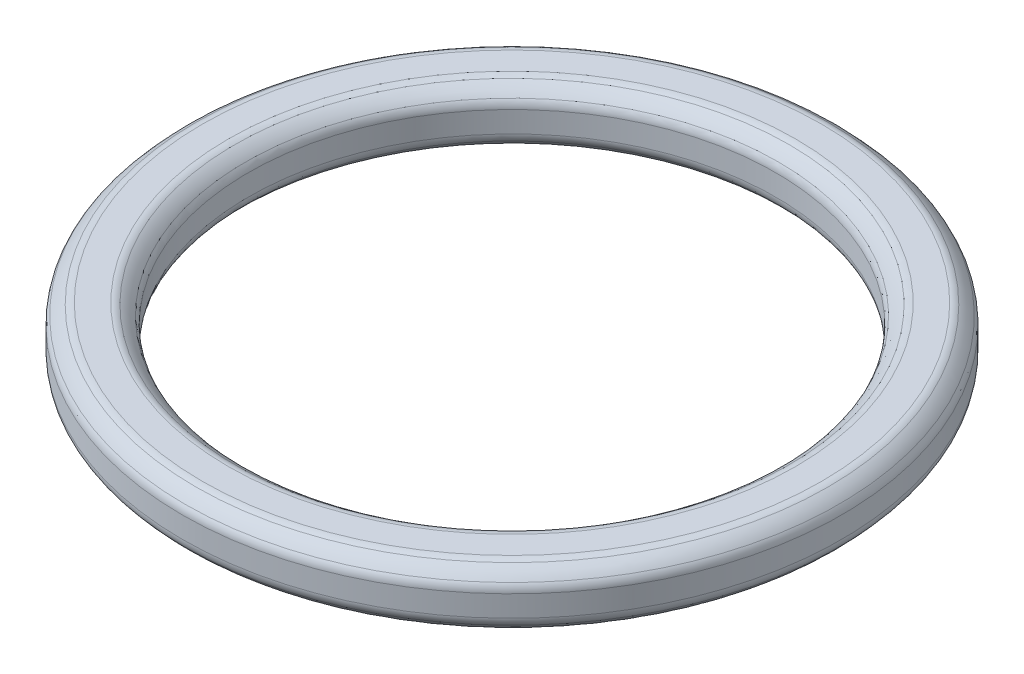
ISO-10303-21;
HEADER;
FILE_DESCRIPTION(('STEP AP214'),'2;1');
FILE_NAME('part.step','',(''),(''),'','','');
FILE_SCHEMA(('AUTOMOTIVE_DESIGN { 1 0 10303 214 1 1 1 1 }'));
ENDSEC;
DATA;
#1=APPLICATION_CONTEXT('core data for automotive mechanical design processes');
#2=APPLICATION_PROTOCOL_DEFINITION('international standard','automotive_design',2000,#1);
#3=PRODUCT_CONTEXT('',#1,'mechanical');
#4=PRODUCT('Part','Part','',(#3));
#5=PRODUCT_RELATED_PRODUCT_CATEGORY('part','',(#4));
#6=PRODUCT_DEFINITION_FORMATION('','',#4);
#7=PRODUCT_DEFINITION_CONTEXT('part definition',#1,'design');
#8=PRODUCT_DEFINITION('design','',#6,#7);
#9=PRODUCT_DEFINITION_SHAPE('','',#8);
#10=(LENGTH_UNIT() NAMED_UNIT(*) SI_UNIT(.MILLI.,.METRE.));
#11=(NAMED_UNIT(*) PLANE_ANGLE_UNIT() SI_UNIT($,.RADIAN.));
#12=(NAMED_UNIT(*) SI_UNIT($,.STERADIAN.) SOLID_ANGLE_UNIT());
#13=UNCERTAINTY_MEASURE_WITH_UNIT(LENGTH_MEASURE(1.E-05),#10,'distance_accuracy_value','');
#14=(GEOMETRIC_REPRESENTATION_CONTEXT(3) GLOBAL_UNCERTAINTY_ASSIGNED_CONTEXT((#13)) GLOBAL_UNIT_ASSIGNED_CONTEXT((#10,
#11,#12)) REPRESENTATION_CONTEXT('',''));
#15=CARTESIAN_POINT('',(0.,0.,0.));
#16=DIRECTION('',(0.,0.,1.));
#17=DIRECTION('',(1.,0.,0.));
#18=AXIS2_PLACEMENT_3D('',#15,#16,#17);
#19=CARTESIAN_POINT('',(9.,0.9,0.));
#20=DIRECTION('',(0.,0.,1.));
#21=DIRECTION('',(1.,0.,0.));
#22=AXIS2_PLACEMENT_3D('',#19,#20,#21);
#23=ELLIPSE('',#22,1.11111111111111,1.);
#24=CARTESIAN_POINT('',(0.,0.,0.));
#25=DIRECTION('',(0.,-1.,0.));
#26=AXIS1_PLACEMENT('',#24,#25);
#27=SURFACE_OF_REVOLUTION('',#23,#26);
#28=CARTESIAN_POINT('',(0.,1.74897301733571,0.));
#29=DIRECTION('',(0.,-1.,0.));
#30=DIRECTION('',(0.,0.,-1.));
#31=AXIS2_PLACEMENT_3D('',#28,#29,#30);
#32=CIRCLE('',#31,9.5871513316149);
#33=CARTESIAN_POINT('',(0.,1.74897301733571,-9.5871513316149));
#34=VERTEX_POINT('',#33);
#35=EDGE_CURVE('E64',#34,#34,#32,.T.);
#36=ORIENTED_EDGE('',*,*,#35,.T.);
#37=EDGE_LOOP('',(#36));
#38=FACE_BOUND('',#37,.T.);
#39=CARTESIAN_POINT('',(0.,1.46156085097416,0.));
#40=DIRECTION('',(0.,-1.,0.));
#41=DIRECTION('',(0.,0.,-1.));
#42=AXIS2_PLACEMENT_3D('',#39,#40,#41);
#43=CIRCLE('',#42,9.91937271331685);
#44=CARTESIAN_POINT('',(0.,1.46156085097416,-9.91937271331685));
#45=VERTEX_POINT('',#44);
#46=EDGE_CURVE('E67',#45,#45,#43,.F.);
#47=ORIENTED_EDGE('',*,*,#46,.T.);
#48=EDGE_LOOP('',(#47));
#49=FACE_BOUND('',#48,.T.);
#50=ADVANCED_FACE('F14',(#38,#49),#27,.F.);
#51=CARTESIAN_POINT('',(8.51567789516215,1.8,0.));
#52=DIRECTION('',(0.,1.,0.));
#53=DIRECTION('',(0.,0.,1.));
#54=AXIS2_PLACEMENT_3D('',#51,#52,#53);
#55=PLANE('',#54);
#56=CARTESIAN_POINT('',(0.,1.8,0.));
#57=DIRECTION('',(0.,1.,0.));
#58=DIRECTION('',(0.,0.,1.));
#59=AXIS2_PLACEMENT_3D('',#56,#57,#58);
#60=CIRCLE('',#59,9.39165751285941);
#61=CARTESIAN_POINT('',(0.,1.8,9.39165751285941));
#62=VERTEX_POINT('',#61);
#63=EDGE_CURVE('E58',#62,#62,#60,.T.);
#64=ORIENTED_EDGE('',*,*,#63,.T.);
#65=EDGE_LOOP('',(#64));
#66=FACE_BOUND('',#65,.T.);
#67=CARTESIAN_POINT('',(0.,1.8,0.));
#68=DIRECTION('',(0.,1.,0.));
#69=DIRECTION('',(0.,0.,1.));
#70=AXIS2_PLACEMENT_3D('',#67,#68,#69);
#71=CIRCLE('',#70,8.6083424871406);
#72=CARTESIAN_POINT('',(0.,1.8,8.6083424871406));
#73=VERTEX_POINT('',#72);
#74=EDGE_CURVE('E61',#73,#73,#71,.F.);
#75=ORIENTED_EDGE('',*,*,#74,.T.);
#76=EDGE_LOOP('',(#75));
#77=FACE_BOUND('',#76,.T.);
#78=ADVANCED_FACE('F96',(#66,#77),#55,.T.);
#79=CARTESIAN_POINT('',(9.,0.9,0.));
#80=DIRECTION('',(0.,0.,1.));
#81=DIRECTION('',(1.,0.,0.));
#82=AXIS2_PLACEMENT_3D('',#79,#80,#81);
#83=ELLIPSE('',#82,1.11111111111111,1.);
#84=CARTESIAN_POINT('',(0.,0.,0.));
#85=DIRECTION('',(0.,-1.,0.));
#86=AXIS1_PLACEMENT('',#84,#85);
#87=SURFACE_OF_REVOLUTION('',#83,#86);
#88=CARTESIAN_POINT('',(0.,1.74897301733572,0.));
#89=DIRECTION('',(0.,-1.,0.));
#90=DIRECTION('',(0.,0.,-1.));
#91=AXIS2_PLACEMENT_3D('',#88,#89,#90);
#92=CIRCLE('',#91,8.41284866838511);
#93=CARTESIAN_POINT('',(0.,1.74897301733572,-8.41284866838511));
#94=VERTEX_POINT('',#93);
#95=EDGE_CURVE('E52',#94,#94,#92,.F.);
#96=ORIENTED_EDGE('',*,*,#95,.T.);
#97=EDGE_LOOP('',(#96));
#98=FACE_BOUND('',#97,.T.);
#99=CARTESIAN_POINT('',(0.,1.46156085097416,0.));
#100=DIRECTION('',(0.,-1.,0.));
#101=DIRECTION('',(0.,0.,-1.));
#102=AXIS2_PLACEMENT_3D('',#99,#100,#101);
#103=CIRCLE('',#102,8.08062728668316);
#104=CARTESIAN_POINT('',(0.,1.46156085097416,-8.08062728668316));
#105=VERTEX_POINT('',#104);
#106=EDGE_CURVE('E55',#105,#105,#103,.T.);
#107=ORIENTED_EDGE('',*,*,#106,.T.);
#108=EDGE_LOOP('',(#107));
#109=FACE_BOUND('',#108,.T.);
#110=ADVANCED_FACE('F92',(#98,#109),#87,.F.);
#111=CARTESIAN_POINT('',(0.,0.,0.));
#112=DIRECTION('',(0.,-1.,0.));
#113=DIRECTION('',(0.,0.,-1.));
#114=AXIS2_PLACEMENT_3D('',#111,#112,#113);
#115=CYLINDRICAL_SURFACE('',#114,8.);
#116=CARTESIAN_POINT('',(0.,1.22072673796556,0.));
#117=DIRECTION('',(0.,1.,0.));
#118=DIRECTION('',(0.,0.,1.));
#119=AXIS2_PLACEMENT_3D('',#116,#117,#118);
#120=CIRCLE('',#119,8.);
#121=CARTESIAN_POINT('',(0.,1.22072673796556,8.));
#122=VERTEX_POINT('',#121);
#123=EDGE_CURVE('E46',#122,#122,#120,.T.);
#124=ORIENTED_EDGE('',*,*,#123,.T.);
#125=EDGE_LOOP('',(#124));
#126=FACE_BOUND('',#125,.T.);
#127=CARTESIAN_POINT('',(0.,0.579273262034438,0.));
#128=DIRECTION('',(0.,1.,0.));
#129=DIRECTION('',(0.,0.,1.));
#130=AXIS2_PLACEMENT_3D('',#127,#128,#129);
#131=CIRCLE('',#130,8.);
#132=CARTESIAN_POINT('',(0.,0.579273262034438,8.));
#133=VERTEX_POINT('',#132);
#134=EDGE_CURVE('E49',#133,#133,#131,.F.);
#135=ORIENTED_EDGE('',*,*,#134,.T.);
#136=EDGE_LOOP('',(#135));
#137=FACE_BOUND('',#136,.T.);
#138=ADVANCED_FACE('F88',(#126,#137),#115,.F.);
#139=CARTESIAN_POINT('',(9.,0.9,0.));
#140=DIRECTION('',(0.,0.,1.));
#141=DIRECTION('',(1.,0.,0.));
#142=AXIS2_PLACEMENT_3D('',#139,#140,#141);
#143=ELLIPSE('',#142,1.11111111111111,1.);
#144=CARTESIAN_POINT('',(0.,0.,0.));
#145=DIRECTION('',(0.,-1.,0.));
#146=AXIS1_PLACEMENT('',#144,#145);
#147=SURFACE_OF_REVOLUTION('',#143,#146);
#148=CARTESIAN_POINT('',(0.,0.338439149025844,0.));
#149=DIRECTION('',(0.,-1.,0.));
#150=DIRECTION('',(0.,0.,-1.));
#151=AXIS2_PLACEMENT_3D('',#148,#149,#150);
#152=CIRCLE('',#151,8.08062728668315);
#153=CARTESIAN_POINT('',(0.,0.338439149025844,-8.08062728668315));
#154=VERTEX_POINT('',#153);
#155=EDGE_CURVE('E40',#154,#154,#152,.F.);
#156=ORIENTED_EDGE('',*,*,#155,.T.);
#157=EDGE_LOOP('',(#156));
#158=FACE_BOUND('',#157,.T.);
#159=CARTESIAN_POINT('',(0.,0.0510269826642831,0.));
#160=DIRECTION('',(0.,-1.,0.));
#161=DIRECTION('',(0.,0.,-1.));
#162=AXIS2_PLACEMENT_3D('',#159,#160,#161);
#163=CIRCLE('',#162,8.41284866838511);
#164=CARTESIAN_POINT('',(0.,0.0510269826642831,-8.41284866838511));
#165=VERTEX_POINT('',#164);
#166=EDGE_CURVE('E43',#165,#165,#163,.T.);
#167=ORIENTED_EDGE('',*,*,#166,.T.);
#168=EDGE_LOOP('',(#167));
#169=FACE_BOUND('',#168,.T.);
#170=ADVANCED_FACE('F84',(#158,#169),#147,.F.);
#171=CARTESIAN_POINT('',(8.51567789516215,0.,0.));
#172=DIRECTION('',(0.,-1.,0.));
#173=DIRECTION('',(0.,0.,-1.));
#174=AXIS2_PLACEMENT_3D('',#171,#172,#173);
#175=PLANE('',#174);
#176=CARTESIAN_POINT('',(0.,0.,0.));
#177=DIRECTION('',(0.,-1.,0.));
#178=DIRECTION('',(0.,0.,-1.));
#179=AXIS2_PLACEMENT_3D('',#176,#177,#178);
#180=CIRCLE('',#179,8.6083424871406);
#181=CARTESIAN_POINT('',(0.,0.,-8.6083424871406));
#182=VERTEX_POINT('',#181);
#183=EDGE_CURVE('E34',#182,#182,#180,.F.);
#184=ORIENTED_EDGE('',*,*,#183,.T.);
#185=EDGE_LOOP('',(#184));
#186=FACE_BOUND('',#185,.T.);
#187=CARTESIAN_POINT('',(0.,0.,0.));
#188=DIRECTION('',(0.,-1.,0.));
#189=DIRECTION('',(0.,0.,-1.));
#190=AXIS2_PLACEMENT_3D('',#187,#188,#189);
#191=CIRCLE('',#190,9.39165751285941);
#192=CARTESIAN_POINT('',(0.,0.,-9.39165751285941));
#193=VERTEX_POINT('',#192);
#194=EDGE_CURVE('E37',#193,#193,#191,.T.);
#195=ORIENTED_EDGE('',*,*,#194,.T.);
#196=EDGE_LOOP('',(#195));
#197=FACE_BOUND('',#196,.T.);
#198=ADVANCED_FACE('F80',(#186,#197),#175,.T.);
#199=CARTESIAN_POINT('',(9.,0.9,0.));
#200=DIRECTION('',(0.,0.,1.));
#201=DIRECTION('',(1.,0.,0.));
#202=AXIS2_PLACEMENT_3D('',#199,#200,#201);
#203=ELLIPSE('',#202,1.11111111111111,1.);
#204=CARTESIAN_POINT('',(0.,0.,0.));
#205=DIRECTION('',(0.,-1.,0.));
#206=AXIS1_PLACEMENT('',#204,#205);
#207=SURFACE_OF_REVOLUTION('',#203,#206);
#208=CARTESIAN_POINT('',(0.,0.0510269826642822,0.));
#209=DIRECTION('',(0.,-1.,0.));
#210=DIRECTION('',(0.,0.,-1.));
#211=AXIS2_PLACEMENT_3D('',#208,#209,#210);
#212=CIRCLE('',#211,9.5871513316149);
#213=CARTESIAN_POINT('',(0.,0.0510269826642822,-9.5871513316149));
#214=VERTEX_POINT('',#213);
#215=EDGE_CURVE('E25',#214,#214,#212,.F.);
#216=ORIENTED_EDGE('',*,*,#215,.T.);
#217=EDGE_LOOP('',(#216));
#218=FACE_BOUND('',#217,.T.);
#219=CARTESIAN_POINT('',(0.,0.338439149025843,0.));
#220=DIRECTION('',(0.,-1.,0.));
#221=DIRECTION('',(0.,0.,-1.));
#222=AXIS2_PLACEMENT_3D('',#219,#220,#221);
#223=CIRCLE('',#222,9.91937271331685);
#224=CARTESIAN_POINT('',(0.,0.338439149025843,-9.91937271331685));
#225=VERTEX_POINT('',#224);
#226=EDGE_CURVE('E29',#225,#225,#223,.T.);
#227=ORIENTED_EDGE('',*,*,#226,.T.);
#228=EDGE_LOOP('',(#227));
#229=FACE_BOUND('',#228,.T.);
#230=ADVANCED_FACE('F75',(#218,#229),#207,.F.);
#231=CARTESIAN_POINT('',(0.,0.,0.));
#232=DIRECTION('',(0.,-1.,0.));
#233=DIRECTION('',(0.,0.,-1.));
#234=AXIS2_PLACEMENT_3D('',#231,#232,#233);
#235=CYLINDRICAL_SURFACE('',#234,10.);
#236=CARTESIAN_POINT('',(0.,0.579273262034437,0.));
#237=DIRECTION('',(0.,1.,0.));
#238=DIRECTION('',(0.,0.,1.));
#239=AXIS2_PLACEMENT_3D('',#236,#237,#238);
#240=CIRCLE('',#239,10.);
#241=CARTESIAN_POINT('',(0.,0.579273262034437,10.));
#242=VERTEX_POINT('',#241);
#243=EDGE_CURVE('E10',#242,#242,#240,.T.);
#244=ORIENTED_EDGE('',*,*,#243,.T.);
#245=EDGE_LOOP('',(#244));
#246=FACE_BOUND('',#245,.T.);
#247=CARTESIAN_POINT('',(0.,1.22072673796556,0.));
#248=DIRECTION('',(0.,1.,0.));
#249=DIRECTION('',(0.,0.,1.));
#250=AXIS2_PLACEMENT_3D('',#247,#248,#249);
#251=CIRCLE('',#250,10.);
#252=CARTESIAN_POINT('',(0.,1.22072673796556,10.));
#253=VERTEX_POINT('',#252);
#254=EDGE_CURVE('E21',#253,#253,#251,.F.);
#255=ORIENTED_EDGE('',*,*,#254,.T.);
#256=EDGE_LOOP('',(#255));
#257=FACE_BOUND('',#256,.T.);
#258=ADVANCED_FACE('F79',(#246,#257),#235,.T.);
#259=CARTESIAN_POINT('',(0.,1.4,0.));
#260=DIRECTION('',(0.,-1.,0.));
#261=DIRECTION('',(0.,0.,-1.));
#262=AXIS2_PLACEMENT_3D('',#259,#260,#261);
#263=TOROIDAL_SURFACE('',#262,9.39165751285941,0.4);
#264=ORIENTED_EDGE('',*,*,#63,.F.);
#265=EDGE_LOOP('',(#264));
#266=FACE_BOUND('',#265,.T.);
#267=ORIENTED_EDGE('',*,*,#35,.F.);
#268=EDGE_LOOP('',(#267));
#269=FACE_BOUND('',#268,.T.);
#270=ADVANCED_FACE('F105',(#266,#269),#263,.T.);
#271=CARTESIAN_POINT('',(0.,1.4,0.));
#272=DIRECTION('',(0.,-1.,0.));
#273=DIRECTION('',(0.,0.,-1.));
#274=AXIS2_PLACEMENT_3D('',#271,#272,#273);
#275=TOROIDAL_SURFACE('',#274,8.6083424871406,0.4);
#276=ORIENTED_EDGE('',*,*,#95,.F.);
#277=EDGE_LOOP('',(#276));
#278=FACE_BOUND('',#277,.T.);
#279=ORIENTED_EDGE('',*,*,#74,.F.);
#280=EDGE_LOOP('',(#279));
#281=FACE_BOUND('',#280,.T.);
#282=ADVANCED_FACE('F108',(#278,#281),#275,.T.);
#283=CARTESIAN_POINT('',(0.,1.22072673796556,0.));
#284=DIRECTION('',(0.,1.,0.));
#285=DIRECTION('',(0.,0.,1.));
#286=AXIS2_PLACEMENT_3D('',#283,#284,#285);
#287=TOROIDAL_SURFACE('',#286,8.4,0.4);
#288=ORIENTED_EDGE('',*,*,#123,.F.);
#289=EDGE_LOOP('',(#288));
#290=FACE_BOUND('',#289,.T.);
#291=ORIENTED_EDGE('',*,*,#106,.F.);
#292=EDGE_LOOP('',(#291));
#293=FACE_BOUND('',#292,.T.);
#294=ADVANCED_FACE('F112',(#290,#293),#287,.T.);
#295=CARTESIAN_POINT('',(0.,0.579273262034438,0.));
#296=DIRECTION('',(0.,1.,0.));
#297=DIRECTION('',(0.,0.,1.));
#298=AXIS2_PLACEMENT_3D('',#295,#296,#297);
#299=TOROIDAL_SURFACE('',#298,8.4,0.4);
#300=ORIENTED_EDGE('',*,*,#155,.F.);
#301=EDGE_LOOP('',(#300));
#302=FACE_BOUND('',#301,.T.);
#303=ORIENTED_EDGE('',*,*,#134,.F.);
#304=EDGE_LOOP('',(#303));
#305=FACE_BOUND('',#304,.T.);
#306=ADVANCED_FACE('F116',(#302,#305),#299,.T.);
#307=CARTESIAN_POINT('',(0.,0.4,0.));
#308=DIRECTION('',(0.,-1.,0.));
#309=DIRECTION('',(0.,0.,-1.));
#310=AXIS2_PLACEMENT_3D('',#307,#308,#309);
#311=TOROIDAL_SURFACE('',#310,8.6083424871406,0.4);
#312=ORIENTED_EDGE('',*,*,#183,.F.);
#313=EDGE_LOOP('',(#312));
#314=FACE_BOUND('',#313,.T.);
#315=ORIENTED_EDGE('',*,*,#166,.F.);
#316=EDGE_LOOP('',(#315));
#317=FACE_BOUND('',#316,.T.);
#318=ADVANCED_FACE('F120',(#314,#317),#311,.T.);
#319=CARTESIAN_POINT('',(0.,0.4,0.));
#320=DIRECTION('',(0.,-1.,0.));
#321=DIRECTION('',(0.,0.,-1.));
#322=AXIS2_PLACEMENT_3D('',#319,#320,#321);
#323=TOROIDAL_SURFACE('',#322,9.39165751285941,0.4);
#324=ORIENTED_EDGE('',*,*,#215,.F.);
#325=EDGE_LOOP('',(#324));
#326=FACE_BOUND('',#325,.T.);
#327=ORIENTED_EDGE('',*,*,#194,.F.);
#328=EDGE_LOOP('',(#327));
#329=FACE_BOUND('',#328,.T.);
#330=ADVANCED_FACE('F124',(#326,#329),#323,.T.);
#331=CARTESIAN_POINT('',(0.,0.579273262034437,0.));
#332=DIRECTION('',(0.,1.,0.));
#333=DIRECTION('',(0.,0.,1.));
#334=AXIS2_PLACEMENT_3D('',#331,#332,#333);
#335=TOROIDAL_SURFACE('',#334,9.6,0.4);
#336=ORIENTED_EDGE('',*,*,#243,.F.);
#337=EDGE_LOOP('',(#336));
#338=FACE_BOUND('',#337,.T.);
#339=ORIENTED_EDGE('',*,*,#226,.F.);
#340=EDGE_LOOP('',(#339));
#341=FACE_BOUND('',#340,.T.);
#342=ADVANCED_FACE('F127',(#338,#341),#335,.T.);
#343=CARTESIAN_POINT('',(0.,1.22072673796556,0.));
#344=DIRECTION('',(0.,1.,0.));
#345=DIRECTION('',(0.,0.,1.));
#346=AXIS2_PLACEMENT_3D('',#343,#344,#345);
#347=TOROIDAL_SURFACE('',#346,9.6,0.4);
#348=ORIENTED_EDGE('',*,*,#46,.F.);
#349=EDGE_LOOP('',(#348));
#350=FACE_BOUND('',#349,.T.);
#351=ORIENTED_EDGE('',*,*,#254,.F.);
#352=EDGE_LOOP('',(#351));
#353=FACE_BOUND('',#352,.T.);
#354=ADVANCED_FACE('F16',(#350,#353),#347,.T.);
#355=CLOSED_SHELL('',(#50,#78,#110,#138,#170,#198,#230,#258,#270,#282,#294,#306,#318,#330,#342,#354));
#356=MANIFOLD_SOLID_BREP('B1',#355);
#357=ADVANCED_BREP_SHAPE_REPRESENTATION('',(#18,#356),#14);
#358=SHAPE_DEFINITION_REPRESENTATION(#9,#357);
ENDSEC;
END-ISO-10303-21;
